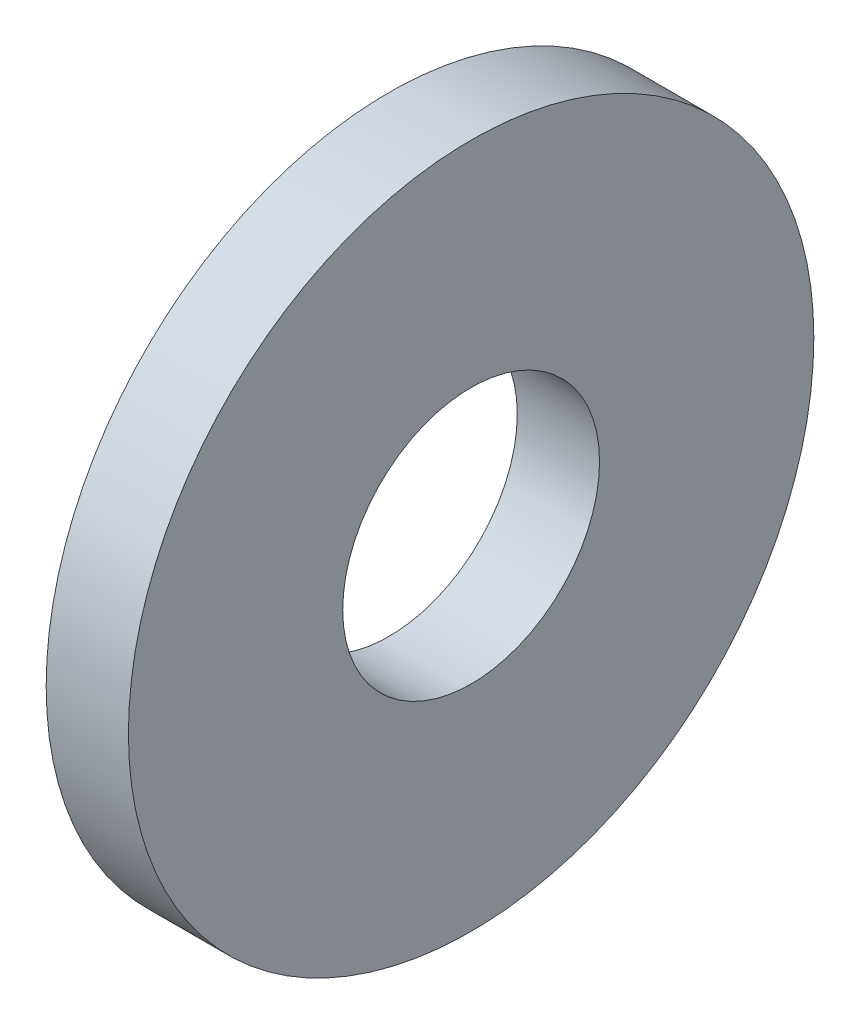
ISO-10303-21;
HEADER;
FILE_DESCRIPTION(('STEP AP214'),'2;1');
FILE_NAME('part.step','',(''),(''),'','','');
FILE_SCHEMA(('AUTOMOTIVE_DESIGN { 1 0 10303 214 1 1 1 1 }'));
ENDSEC;
DATA;
#1=APPLICATION_CONTEXT('core data for automotive mechanical design processes');
#2=APPLICATION_PROTOCOL_DEFINITION('international standard','automotive_design',2000,#1);
#3=PRODUCT_CONTEXT('',#1,'mechanical');
#4=PRODUCT('Part','Part','',(#3));
#5=PRODUCT_RELATED_PRODUCT_CATEGORY('part','',(#4));
#6=PRODUCT_DEFINITION_FORMATION('','',#4);
#7=PRODUCT_DEFINITION_CONTEXT('part definition',#1,'design');
#8=PRODUCT_DEFINITION('design','',#6,#7);
#9=PRODUCT_DEFINITION_SHAPE('','',#8);
#10=(LENGTH_UNIT() NAMED_UNIT(*) SI_UNIT(.MILLI.,.METRE.));
#11=(NAMED_UNIT(*) PLANE_ANGLE_UNIT() SI_UNIT($,.RADIAN.));
#12=(NAMED_UNIT(*) SI_UNIT($,.STERADIAN.) SOLID_ANGLE_UNIT());
#13=UNCERTAINTY_MEASURE_WITH_UNIT(LENGTH_MEASURE(1.E-05),#10,'distance_accuracy_value','');
#14=(GEOMETRIC_REPRESENTATION_CONTEXT(3) GLOBAL_UNCERTAINTY_ASSIGNED_CONTEXT((#13)) GLOBAL_UNIT_ASSIGNED_CONTEXT((#10,
#11,#12)) REPRESENTATION_CONTEXT('',''));
#15=CARTESIAN_POINT('',(0.,0.,0.));
#16=DIRECTION('',(0.,0.,1.));
#17=DIRECTION('',(1.,0.,0.));
#18=AXIS2_PLACEMENT_3D('',#15,#16,#17);
#19=CARTESIAN_POINT('',(2.286,0.,0.));
#20=DIRECTION('',(1.,0.,0.));
#21=DIRECTION('',(0.,0.,-1.));
#22=AXIS2_PLACEMENT_3D('',#19,#20,#21);
#23=PLANE('',#22);
#24=CARTESIAN_POINT('',(2.286,0.,0.));
#25=DIRECTION('',(1.,0.,0.));
#26=DIRECTION('',(0.,0.,-1.));
#27=AXIS2_PLACEMENT_3D('',#24,#25,#26);
#28=CIRCLE('',#27,9.525);
#29=CARTESIAN_POINT('',(2.286,0.,-9.525));
#30=VERTEX_POINT('',#29);
#31=EDGE_CURVE('E10',#30,#30,#28,.T.);
#32=ORIENTED_EDGE('',*,*,#31,.T.);
#33=EDGE_LOOP('',(#32));
#34=FACE_BOUND('',#33,.T.);
#35=CARTESIAN_POINT('',(2.286,0.,0.));
#36=DIRECTION('',(1.,0.,0.));
#37=DIRECTION('',(0.,0.,-1.));
#38=AXIS2_PLACEMENT_3D('',#35,#36,#37);
#39=CIRCLE('',#38,3.5687);
#40=CARTESIAN_POINT('',(2.286,0.,-3.5687));
#41=VERTEX_POINT('',#40);
#42=EDGE_CURVE('E45',#41,#41,#39,.T.);
#43=ORIENTED_EDGE('',*,*,#42,.F.);
#44=EDGE_LOOP('',(#43));
#45=FACE_BOUND('',#44,.T.);
#46=ADVANCED_FACE('F34',(#34,#45),#23,.T.);
#47=CARTESIAN_POINT('',(0.,0.,0.));
#48=DIRECTION('',(1.,0.,0.));
#49=DIRECTION('',(0.,0.,-1.));
#50=AXIS2_PLACEMENT_3D('',#47,#48,#49);
#51=PLANE('',#50);
#52=CARTESIAN_POINT('',(0.,0.,0.));
#53=DIRECTION('',(1.,0.,0.));
#54=DIRECTION('',(0.,0.,-1.));
#55=AXIS2_PLACEMENT_3D('',#52,#53,#54);
#56=CIRCLE('',#55,9.525);
#57=CARTESIAN_POINT('',(0.,0.,-9.525));
#58=VERTEX_POINT('',#57);
#59=EDGE_CURVE('E38',#58,#58,#56,.T.);
#60=ORIENTED_EDGE('',*,*,#59,.F.);
#61=EDGE_LOOP('',(#60));
#62=FACE_BOUND('',#61,.T.);
#63=CARTESIAN_POINT('',(0.,0.,0.));
#64=DIRECTION('',(1.,0.,0.));
#65=DIRECTION('',(0.,0.,-1.));
#66=AXIS2_PLACEMENT_3D('',#63,#64,#65);
#67=CIRCLE('',#66,3.5687);
#68=CARTESIAN_POINT('',(0.,0.,-3.5687));
#69=VERTEX_POINT('',#68);
#70=EDGE_CURVE('E47',#69,#69,#67,.T.);
#71=ORIENTED_EDGE('',*,*,#70,.T.);
#72=EDGE_LOOP('',(#71));
#73=FACE_BOUND('',#72,.T.);
#74=ADVANCED_FACE('F57',(#62,#73),#51,.F.);
#75=CARTESIAN_POINT('',(2.286,0.,0.));
#76=DIRECTION('',(-1.,0.,0.));
#77=DIRECTION('',(0.,0.,1.));
#78=AXIS2_PLACEMENT_3D('',#75,#76,#77);
#79=CYLINDRICAL_SURFACE('',#78,9.525);
#80=ORIENTED_EDGE('',*,*,#31,.F.);
#81=EDGE_LOOP('',(#80));
#82=FACE_BOUND('',#81,.T.);
#83=ORIENTED_EDGE('',*,*,#59,.T.);
#84=EDGE_LOOP('',(#83));
#85=FACE_BOUND('',#84,.T.);
#86=ADVANCED_FACE('F36',(#82,#85),#79,.T.);
#87=CARTESIAN_POINT('',(2.286,0.,0.));
#88=DIRECTION('',(-1.,0.,0.));
#89=DIRECTION('',(0.,0.,1.));
#90=AXIS2_PLACEMENT_3D('',#87,#88,#89);
#91=CYLINDRICAL_SURFACE('',#90,3.5687);
#92=ORIENTED_EDGE('',*,*,#42,.T.);
#93=EDGE_LOOP('',(#92));
#94=FACE_BOUND('',#93,.T.);
#95=ORIENTED_EDGE('',*,*,#70,.F.);
#96=EDGE_LOOP('',(#95));
#97=FACE_BOUND('',#96,.T.);
#98=ADVANCED_FACE('F53',(#94,#97),#91,.F.);
#99=CLOSED_SHELL('',(#46,#74,#86,#98));
#100=MANIFOLD_SOLID_BREP('B2',#99);
#101=ADVANCED_BREP_SHAPE_REPRESENTATION('',(#18,#100),#14);
#102=SHAPE_DEFINITION_REPRESENTATION(#9,#101);
ENDSEC;
END-ISO-10303-21;
